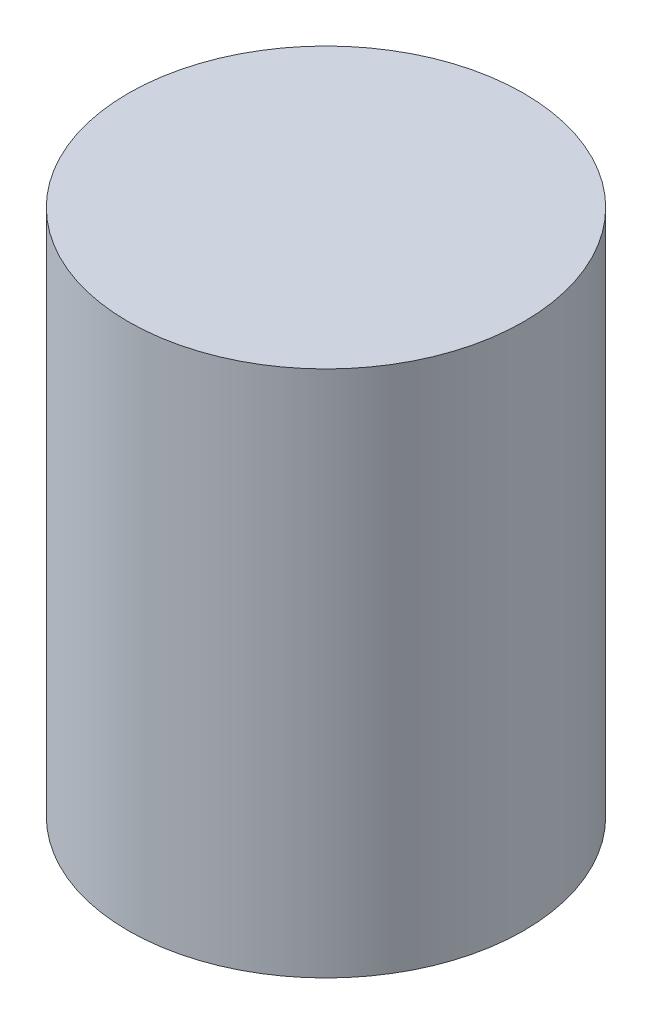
from build123d import *

# Parameters (mm, degrees)
CROQUIS2_R              = 15
SALIENTE_EXTRUIR1_DEPTH = 40


with BuildPart() as part:
    # Croquis2 → Saliente-Extruir1 (new body)
    with BuildSketch(Plane(origin=(0, 0, 0), x_dir=(1, 0, 0), z_dir=(0, 1, 0))):
        with Locations(Location((0, 0, 0), (0, 0, 270))):
            Circle(CROQUIS2_R)
    extrude(amount=SALIENTE_EXTRUIR1_DEPTH)


solid = part.part
